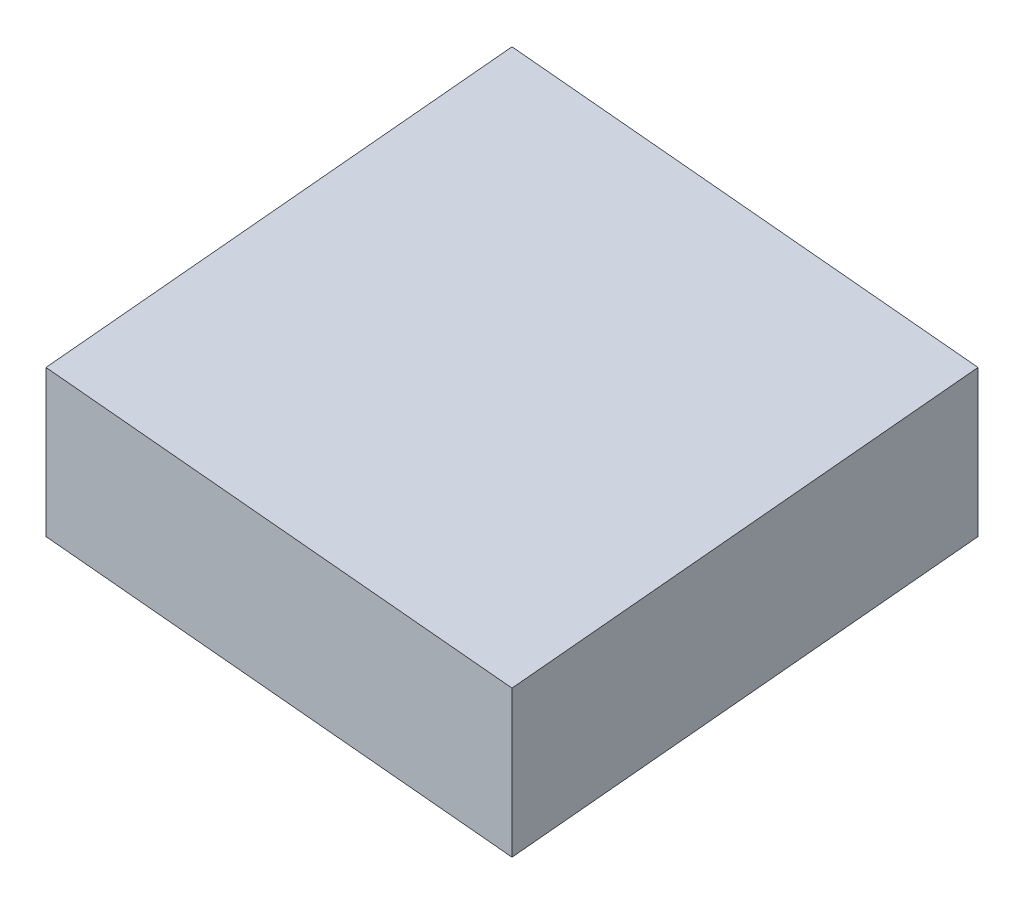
from build123d import *

# Parameters (mm, degrees)
ESQCORPS_R       = 0.0005
CORPS_DEPTH      = 0.0005
PLAQUETTEC_DEPTH = 2.571428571


with BuildPart() as part:
    # EsqCorps → Corps (new, symmetric)
    with BuildSketch(Plane(origin=(0, 0, 0), x_dir=(1, 0, 0), z_dir=(0, 1, 0))):
        with Locations(Location((0, 0, 0), (0, 0, 270))):
            Circle(ESQCORPS_R)
    extrude(amount=CORPS_DEPTH, both=True)

    # EsqC → PlaquetteC (add)
    with BuildSketch(Plane(origin=(0, 0, 0), x_dir=(1, 0, 0), z_dir=(0, 1, 0))):
        with BuildLine():
            Line((-0.000996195, -8.7156e-05), (0.783318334, -8.964843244))
            ThreePointArc((0.783318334, -8.964843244), (0.783607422, -8.965463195), (0.784227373, -8.965752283))
            Line((0.784227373, -8.965752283), (9.748983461, -9.750066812))
            ThreePointArc((9.748983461, -9.750066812), (9.749777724, -9.749777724), (9.750066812, -9.748983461))
            Line((9.750066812, -9.748983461), (8.965752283, -0.784227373))
            ThreePointArc((8.965752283, -0.784227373), (8.965463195, -0.783607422), (8.964843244, -0.783318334))
            Line((8.964843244, -0.783318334), (8.7156e-05, 0.000996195))
            ThreePointArc((8.7156e-05, 0.000996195), (-0.000707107, 0.000707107), (-0.000996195, -8.7156e-05))
        make_face()
    extrude(amount=-PLAQUETTEC_DEPTH)


solid = part.part
